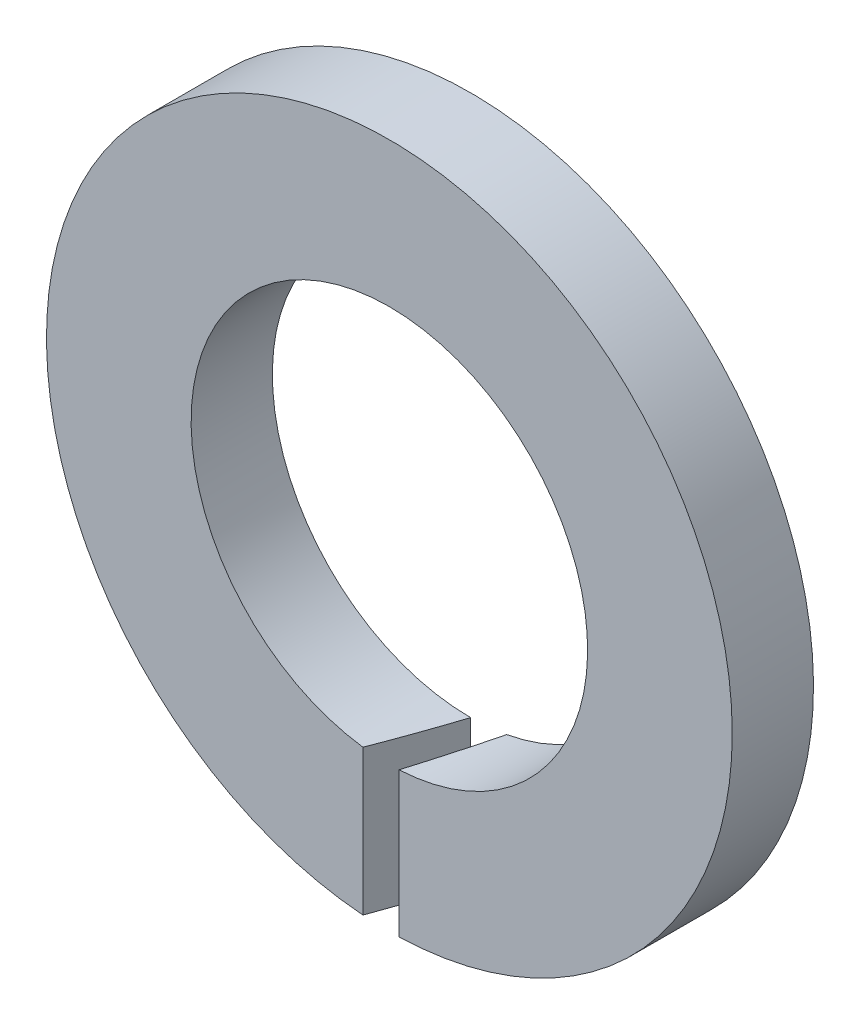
ISO-10303-21;
HEADER;
FILE_DESCRIPTION(('STEP AP214'),'2;1');
FILE_NAME('part.step','',(''),(''),'','','');
FILE_SCHEMA(('AUTOMOTIVE_DESIGN { 1 0 10303 214 1 1 1 1 }'));
ENDSEC;
DATA;
#1=APPLICATION_CONTEXT('core data for automotive mechanical design processes');
#2=APPLICATION_PROTOCOL_DEFINITION('international standard','automotive_design',2000,#1);
#3=PRODUCT_CONTEXT('',#1,'mechanical');
#4=PRODUCT('Part','Part','',(#3));
#5=PRODUCT_RELATED_PRODUCT_CATEGORY('part','',(#4));
#6=PRODUCT_DEFINITION_FORMATION('','',#4);
#7=PRODUCT_DEFINITION_CONTEXT('part definition',#1,'design');
#8=PRODUCT_DEFINITION('design','',#6,#7);
#9=PRODUCT_DEFINITION_SHAPE('','',#8);
#10=(LENGTH_UNIT() NAMED_UNIT(*) SI_UNIT(.MILLI.,.METRE.));
#11=(NAMED_UNIT(*) PLANE_ANGLE_UNIT() SI_UNIT($,.RADIAN.));
#12=(NAMED_UNIT(*) SI_UNIT($,.STERADIAN.) SOLID_ANGLE_UNIT());
#13=UNCERTAINTY_MEASURE_WITH_UNIT(LENGTH_MEASURE(1.E-05),#10,'distance_accuracy_value','');
#14=(GEOMETRIC_REPRESENTATION_CONTEXT(3) GLOBAL_UNCERTAINTY_ASSIGNED_CONTEXT((#13)) GLOBAL_UNIT_ASSIGNED_CONTEXT((#10,
#11,#12)) REPRESENTATION_CONTEXT('',''));
#15=CARTESIAN_POINT('',(0.,0.,0.));
#16=DIRECTION('',(0.,0.,1.));
#17=DIRECTION('',(1.,0.,0.));
#18=AXIS2_PLACEMENT_3D('',#15,#16,#17);
#19=CARTESIAN_POINT('',(0.,0.,2.5));
#20=DIRECTION('',(0.,0.,1.));
#21=DIRECTION('',(0.,-1.,0.));
#22=AXIS2_PLACEMENT_3D('',#19,#20,#21);
#23=PLANE('',#22);
#24=DIRECTION('',(0.,-1.,0.));
#25=VECTOR('',#24,1.);
#26=CARTESIAN_POINT('',(-0.812299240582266,0.,2.5));
#27=LINE('',#26,#25);
#28=CARTESIAN_POINT('',(-0.812299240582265,-6.04567365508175,2.5));
#29=VERTEX_POINT('',#28);
#30=CARTESIAN_POINT('',(-0.812299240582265,-10.5186819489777,2.5));
#31=VERTEX_POINT('',#30);
#32=EDGE_CURVE('E84',#29,#31,#27,.T.);
#33=ORIENTED_EDGE('',*,*,#32,.F.);
#34=CARTESIAN_POINT('',(0.,0.,2.5));
#35=DIRECTION('',(0.,0.,1.));
#36=DIRECTION('',(0.,-1.,0.));
#37=AXIS2_PLACEMENT_3D('',#34,#35,#36);
#38=CIRCLE('',#37,6.1);
#39=CARTESIAN_POINT('',(0.296993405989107,-6.09276578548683,2.5));
#40=VERTEX_POINT('',#39);
#41=EDGE_CURVE('E75',#40,#29,#38,.T.);
#42=ORIENTED_EDGE('',*,*,#41,.F.);
#43=DIRECTION('',(0.,1.,0.));
#44=VECTOR('',#43,1.);
#45=CARTESIAN_POINT('',(0.296993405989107,0.,2.5));
#46=LINE('',#45,#44);
#47=CARTESIAN_POINT('',(0.296993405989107,-10.5458188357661,2.5));
#48=VERTEX_POINT('',#47);
#49=EDGE_CURVE('E39',#48,#40,#46,.T.);
#50=ORIENTED_EDGE('',*,*,#49,.F.);
#51=CARTESIAN_POINT('',(0.,0.,2.5));
#52=DIRECTION('',(0.,0.,-1.));
#53=DIRECTION('',(1.,0.,0.));
#54=AXIS2_PLACEMENT_3D('',#51,#52,#53);
#55=CIRCLE('',#54,10.55);
#56=EDGE_CURVE('E63',#31,#48,#55,.T.);
#57=ORIENTED_EDGE('',*,*,#56,.F.);
#58=EDGE_LOOP('',(#33,#42,#50,#57));
#59=FACE_BOUND('',#58,.T.);
#60=ADVANCED_FACE('F16',(#59),#23,.T.);
#61=CARTESIAN_POINT('',(0.,0.,0.));
#62=DIRECTION('',(0.,0.,-1.));
#63=DIRECTION('',(0.,1.,0.));
#64=AXIS2_PLACEMENT_3D('',#61,#62,#63);
#65=PLANE('',#64);
#66=DIRECTION('',(0.,1.,0.));
#67=VECTOR('',#66,1.);
#68=CARTESIAN_POINT('',(0.,0.,0.));
#69=LINE('',#68,#67);
#70=CARTESIAN_POINT('',(0.,-10.55,0.));
#71=VERTEX_POINT('',#70);
#72=CARTESIAN_POINT('',(0.,-6.1,0.));
#73=VERTEX_POINT('',#72);
#74=EDGE_CURVE('E32',#71,#73,#69,.T.);
#75=ORIENTED_EDGE('',*,*,#74,.F.);
#76=CARTESIAN_POINT('',(0.,0.,0.));
#77=DIRECTION('',(0.,0.,1.));
#78=DIRECTION('',(1.,0.,0.));
#79=AXIS2_PLACEMENT_3D('',#76,#77,#78);
#80=CIRCLE('',#79,10.55);
#81=CARTESIAN_POINT('',(1.10929264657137,-10.491518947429,0.));
#82=VERTEX_POINT('',#81);
#83=EDGE_CURVE('E70',#82,#71,#80,.T.);
#84=ORIENTED_EDGE('',*,*,#83,.F.);
#85=DIRECTION('',(0.,-1.,0.));
#86=VECTOR('',#85,1.);
#87=CARTESIAN_POINT('',(1.10929264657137,0.,0.));
#88=LINE('',#87,#86);
#89=CARTESIAN_POINT('',(1.10929264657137,-5.99828890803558,0.));
#90=VERTEX_POINT('',#89);
#91=EDGE_CURVE('E56',#90,#82,#88,.T.);
#92=ORIENTED_EDGE('',*,*,#91,.F.);
#93=CARTESIAN_POINT('',(0.,0.,0.));
#94=DIRECTION('',(0.,0.,-1.));
#95=DIRECTION('',(0.,1.,0.));
#96=AXIS2_PLACEMENT_3D('',#93,#94,#95);
#97=CIRCLE('',#96,6.1);
#98=EDGE_CURVE('E68',#73,#90,#97,.T.);
#99=ORIENTED_EDGE('',*,*,#98,.F.);
#100=EDGE_LOOP('',(#75,#84,#92,#99));
#101=FACE_BOUND('',#100,.T.);
#102=ADVANCED_FACE('F67',(#101),#65,.T.);
#103=CARTESIAN_POINT('',(0.,0.,0.));
#104=DIRECTION('',(0.,0.,1.));
#105=DIRECTION('',(1.,0.,0.));
#106=AXIS2_PLACEMENT_3D('',#103,#104,#105);
#107=CYLINDRICAL_SURFACE('',#106,10.55);
#108=CARTESIAN_POINT('',(0.,0.,0.));
#109=DIRECTION('',(-0.951056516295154,0.,-0.309016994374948));
#110=DIRECTION('',(-0.309016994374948,0.,0.951056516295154));
#111=AXIS2_PLACEMENT_3D('',#108,#109,#110);
#112=ELLIPSE('',#111,34.1405171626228,10.55);
#113=EDGE_CURVE('E76',#31,#71,#112,.F.);
#114=ORIENTED_EDGE('',*,*,#113,.F.);
#115=ORIENTED_EDGE('',*,*,#56,.T.);
#116=CARTESIAN_POINT('',(0.,0.,3.41405171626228));
#117=DIRECTION('',(0.951056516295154,0.,0.309016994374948));
#118=DIRECTION('',(-0.309016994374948,0.,0.951056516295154));
#119=AXIS2_PLACEMENT_3D('',#116,#117,#118);
#120=ELLIPSE('',#119,34.1405171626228,10.55);
#121=EDGE_CURVE('E96',#82,#48,#120,.F.);
#122=ORIENTED_EDGE('',*,*,#121,.F.);
#123=ORIENTED_EDGE('',*,*,#83,.T.);
#124=EDGE_LOOP('',(#114,#115,#122,#123));
#125=FACE_BOUND('',#124,.T.);
#126=ADVANCED_FACE('F18',(#125),#107,.T.);
#127=CARTESIAN_POINT('',(0.,0.,-1.5));
#128=DIRECTION('',(0.,0.,1.));
#129=DIRECTION('',(1.,0.,0.));
#130=AXIS2_PLACEMENT_3D('',#127,#128,#129);
#131=CYLINDRICAL_SURFACE('',#130,6.1);
#132=ORIENTED_EDGE('',*,*,#41,.T.);
#133=CARTESIAN_POINT('',(0.,0.,0.));
#134=DIRECTION('',(-0.951056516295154,0.,-0.309016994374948));
#135=DIRECTION('',(-0.309016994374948,0.,0.951056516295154));
#136=AXIS2_PLACEMENT_3D('',#133,#134,#135);
#137=ELLIPSE('',#136,19.7400146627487,6.1);
#138=EDGE_CURVE('E11',#29,#73,#137,.F.);
#139=ORIENTED_EDGE('',*,*,#138,.T.);
#140=ORIENTED_EDGE('',*,*,#98,.T.);
#141=CARTESIAN_POINT('',(0.,0.,3.41405171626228));
#142=DIRECTION('',(0.951056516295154,0.,0.309016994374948));
#143=DIRECTION('',(-0.309016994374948,0.,0.951056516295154));
#144=AXIS2_PLACEMENT_3D('',#141,#142,#143);
#145=ELLIPSE('',#144,19.7400146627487,6.1);
#146=EDGE_CURVE('E25',#90,#40,#145,.F.);
#147=ORIENTED_EDGE('',*,*,#146,.T.);
#148=EDGE_LOOP('',(#132,#139,#140,#147));
#149=FACE_BOUND('',#148,.T.);
#150=ADVANCED_FACE('F73',(#149),#131,.F.);
#151=CARTESIAN_POINT('',(1.77590711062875,-10.55,-2.05162836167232));
#152=DIRECTION('',(0.951056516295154,0.,0.309016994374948));
#153=DIRECTION('',(-0.309016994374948,0.,0.951056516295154));
#154=AXIS2_PLACEMENT_3D('',#151,#152,#153);
#155=PLANE('',#154);
#156=ORIENTED_EDGE('',*,*,#121,.T.);
#157=ORIENTED_EDGE('',*,*,#49,.T.);
#158=ORIENTED_EDGE('',*,*,#146,.F.);
#159=ORIENTED_EDGE('',*,*,#91,.T.);
#160=EDGE_LOOP('',(#156,#157,#158,#159));
#161=FACE_BOUND('',#160,.T.);
#162=ADVANCED_FACE('F55',(#161),#155,.F.);
#163=CARTESIAN_POINT('',(0.772542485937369,-10.55,-2.37764129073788));
#164=DIRECTION('',(-0.951056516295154,0.,-0.309016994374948));
#165=DIRECTION('',(0.309016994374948,0.,-0.951056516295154));
#166=AXIS2_PLACEMENT_3D('',#163,#164,#165);
#167=PLANE('',#166);
#168=ORIENTED_EDGE('',*,*,#113,.T.);
#169=ORIENTED_EDGE('',*,*,#74,.T.);
#170=ORIENTED_EDGE('',*,*,#138,.F.);
#171=ORIENTED_EDGE('',*,*,#32,.T.);
#172=EDGE_LOOP('',(#168,#169,#170,#171));
#173=FACE_BOUND('',#172,.T.);
#174=ADVANCED_FACE('F150',(#173),#167,.F.);
#175=CLOSED_SHELL('',(#60,#102,#126,#150,#162,#174));
#176=MANIFOLD_SOLID_BREP('B1',#175);
#177=ADVANCED_BREP_SHAPE_REPRESENTATION('',(#18,#176),#14);
#178=SHAPE_DEFINITION_REPRESENTATION(#9,#177);
ENDSEC;
END-ISO-10303-21;
